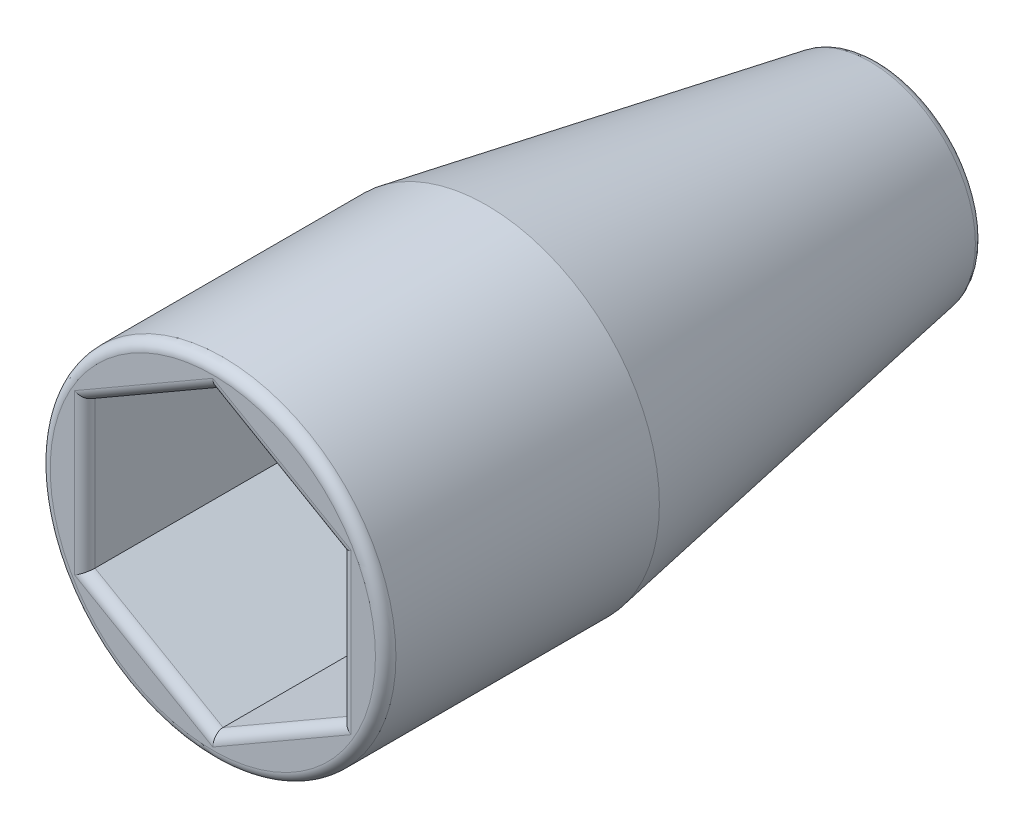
from build123d import *
from OCP.BRepFilletAPI import BRepFilletAPI_MakeChamfer

# Parameters (mm, degrees)
ESQUISSE2_R             = 6.75
BOSS_EXTRU_1_DEPTH      = 26
ENL_V_MAT_EXTRU_1_DEPTH = 12
ESQUISSE4_R             = 3.2
ENL_V_MAT_EXTRU_2_DEPTH = 10
ENL_V_MAT_EXTRU_3_REACH = 20.631
ESQUISSE5_R             = 1.75
CONG_2_R                = 0.4
CHANFREIN2_SIZE         = 0.5
CHANFREIN2_SIZE2        = 0.288675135


with BuildPart() as part:
    # Esquisse2 → Boss.-Extru.1 (new body)
    with BuildSketch(Plane.XY):
        with Locations(Location((0, 0, 0), (0, 0, 180))):
            Circle(ESQUISSE2_R)
    extrude(amount=BOSS_EXTRU_1_DEPTH)

    # Esquisse3 → Enl_v. mat.-Extru.1 (cut)
    with BuildSketch(Plane.XY.offset(26)):
        Polygon((5, -2.886751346), (5, 2.886751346), (0, 5.773502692), (-5, 2.886751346), (-5, -2.886751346), (0, -5.773502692), align=None)
    extrude(amount=-ENL_V_MAT_EXTRU_1_DEPTH, mode=Mode.SUBTRACT)

    # Esquisse4 → Enl_v. mat.-Extru.2 (cut)
    with BuildSketch(Plane(origin=(0, 0, 0), x_dir=(-1, 0, 0), z_dir=(0, 0, -1))):
        Circle(ESQUISSE4_R)
    extrude(amount=-ENL_V_MAT_EXTRU_2_DEPTH, mode=Mode.SUBTRACT)

    # Esquisse5 → Enl_v. mat.-Extru.3 (cut, up to next)
    with BuildSketch(Plane(origin=(0, 0, 10), x_dir=(-1, 0, 0), z_dir=(0, 0, -1)), mode=Mode.PRIVATE) as enl_v_mat_extru_3_sk1:
        Circle(ESQUISSE5_R)
    enl_v_mat_extru_3_tool1 = extrude(enl_v_mat_extru_3_sk1.sketch, amount=-ENL_V_MAT_EXTRU_3_REACH, mode=Mode.PRIVATE) & part.part
    add(enl_v_mat_extru_3_tool1.solids().sort_by_distance((0, 0, 10))[0], mode=Mode.SUBTRACT)

    # Esquisse6 → Enl_vement de mati_re-R_volution1 (revolve, cut)
    with BuildSketch(Plane(origin=(0, 0, 0), x_dir=(1, 0, 0), z_dir=(0, 1, 0))):
        Polygon((-4.05, 0), (-6.75, -15.312460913), (-6.75, 0), align=None)
    revolve(axis=Axis((0, 0, -6.005245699), (0, 0, 1)), mode=Mode.SUBTRACT)

    # Cong_2
    cong_2_edges = [part.edges().sort_by_distance(p)[0] for p in [
        (2.5, -4.330127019, 26),
        (5, 0, 26),
        (2.5, 4.330127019, 26),
        (-2.5, 4.330127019, 26),
        (-5, 0, 26),
        (-2.5, -4.330127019, 26),
        (3.2, 0, 0),
        (4.05, 0, 0),
        (6.75, 0, 26),
    ]]
    fillet(cong_2_edges, radius=CONG_2_R)

    # Chanfrein2: one chamfer whose edges measure the first distance from different faces: ONE call of the kernel's chamfer builder (chamfer() names one face for all edges)
    chanfrein2_edges_1 = [part.edges().sort_by_distance(p)[0] for p in [
        (1.75, 0, 14),
    ]]
    chanfrein2_side_1 = [part.faces().sort_by_distance(p)[0] for p in [
        (1.75, 0, 12),
    ]]
    chanfrein2_edges_2 = [part.edges().sort_by_distance(p)[0] for p in [
        (1.75, 0, 10),
    ]]
    chanfrein2_side_2 = [part.faces().sort_by_distance(p)[0] for p in [
        (3.109490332, 0, 10),
    ]]
    chanfrein2 = BRepFilletAPI_MakeChamfer(part.part.solid().wrapped)
    for e in chanfrein2_edges_1:
        chanfrein2.Add(CHANFREIN2_SIZE, CHANFREIN2_SIZE2, e.wrapped, chanfrein2_side_1[0].wrapped)  # the first distance lies on this face
    for e in chanfrein2_edges_2:
        chanfrein2.Add(CHANFREIN2_SIZE, CHANFREIN2_SIZE2, e.wrapped, chanfrein2_side_2[0].wrapped)  # the first distance lies on this face
    add(Compound.cast(chanfrein2.Shape()), mode=Mode.REPLACE)


solid = part.part
